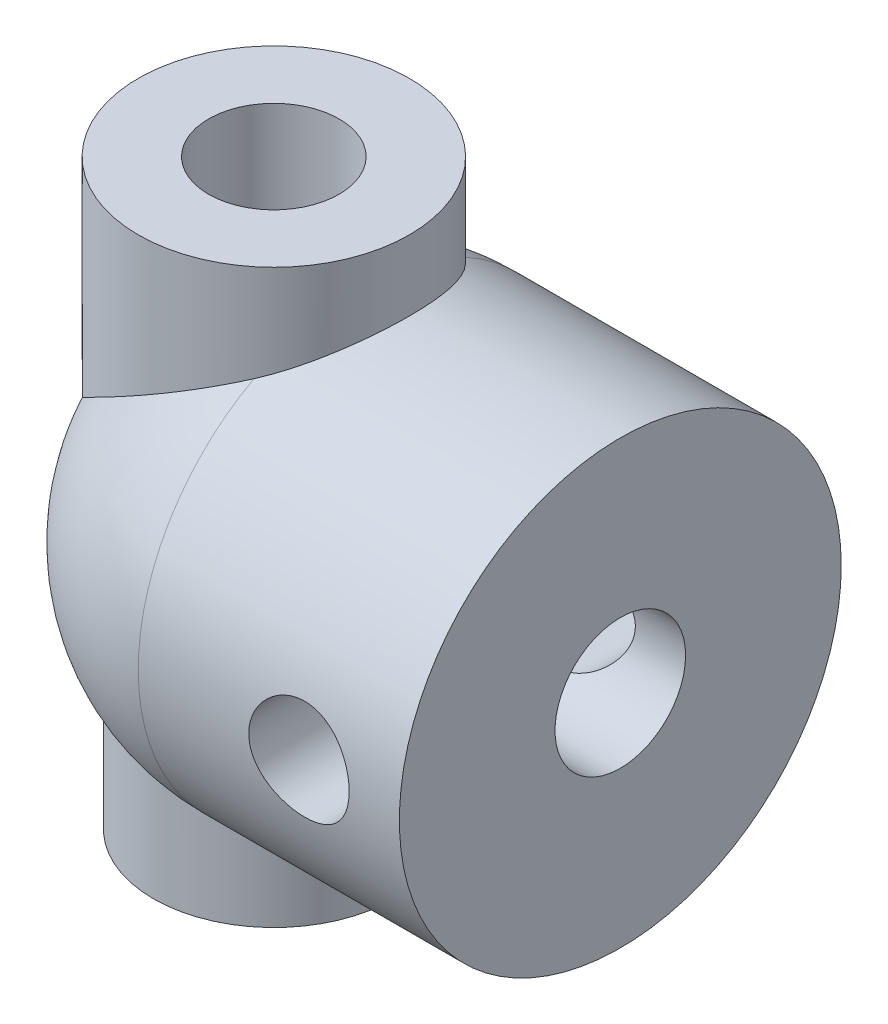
from build123d import *

# Parameters (mm, degrees)
SKETCH_1_R               = 88
EXTRUDE_1_DEPTH          = 104
SKETCH_3_R               = 54
EXTRUDE_2_DEPTH          = 116
SKETCH_4_R               = 48
EXTRUDE_3_DEPTH          = 116
SKETCH_5_R               = 26
CUT_EXTRUDE_1_DEPTH      = 270.04274769
SKETCH_6_R               = 26
CUT_EXTRUDE_2_DEPTH      = 138
CUT_EXTRUDE_3_DEPTH      = 179.930154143
CUT_EXTRUDE_3_DEPTH_BACK = 179.930154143
SKETCH_8_R               = 20


with BuildPart() as part:
    # Sketch 1 → Extrude 1 (new body)
    with BuildSketch(Plane(origin=(0, 0, 0), x_dir=(0, 0, -1), z_dir=(1, 0, 0))):
        with Locations(Location((0, 0, 0), (0, 0, 180))):
            Circle(SKETCH_1_R)
    extrude(amount=EXTRUDE_1_DEPTH)

    # Sketch 2 → Revolve 1 (revolve)
    with BuildSketch(Plane.XY):
        with BuildLine():
            Line((-88, 0), (0, 0))
            Line((0, 0), (0, 88))
            ThreePointArc((0, 88), (-62.225396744, 62.225396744), (-88, 0))
        make_face()
    revolve(axis=Axis((-88, 0, 0), (1, 0, 0)))

    # Sketch 3 → Extrude 2 (add)
    with BuildSketch(Plane(origin=(0, 0, 0), x_dir=(1, 0, 0), z_dir=(0, 1, 0))):
        with Locations(Location((-34, 0, 0), (0, 0, 50.977197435))):
            Circle(SKETCH_3_R)
    extrude(amount=EXTRUDE_2_DEPTH)

    # Sketch 4 → Extrude 3 (add)
    with BuildSketch(Plane(origin=(0, 0, 0), x_dir=(1, 0, 0), z_dir=(0, 1, 0))):
        with Locations(Location((-34, 0, 0), (0, 0, 270))):
            Circle(SKETCH_4_R)
    extrude(amount=-EXTRUDE_3_DEPTH)

    # Sketch 5 → Cut-Extrude 1 (cut, through all)
    with BuildSketch(Plane(origin=(0, 116, 0), x_dir=(1, 0, 0), z_dir=(0, 1, 0))):
        with Locations(Location((-34, 0, 0), (0, 0, 270))):
            Circle(SKETCH_5_R)
    extrude(amount=-CUT_EXTRUDE_1_DEPTH, mode=Mode.SUBTRACT)

    # Sketch 6 → Cut-Extrude 2 (cut)
    with BuildSketch(Plane(origin=(104, 0, 0), x_dir=(0, 0, -1), z_dir=(1, 0, 0))):
        Circle(SKETCH_6_R)
    extrude(amount=-CUT_EXTRUDE_2_DEPTH, mode=Mode.SUBTRACT)

    # Sketch 8 → Cut-Extrude 3 (cut, two sides: drawn at the far end of the back side and taken through both)
    with BuildSketch(Plane.XY.offset(-CUT_EXTRUDE_3_DEPTH_BACK)):
        with Locations((64, 0)):
            Circle(SKETCH_8_R)
    extrude(amount=CUT_EXTRUDE_3_DEPTH + CUT_EXTRUDE_3_DEPTH_BACK, mode=Mode.SUBTRACT)


solid = part.part
